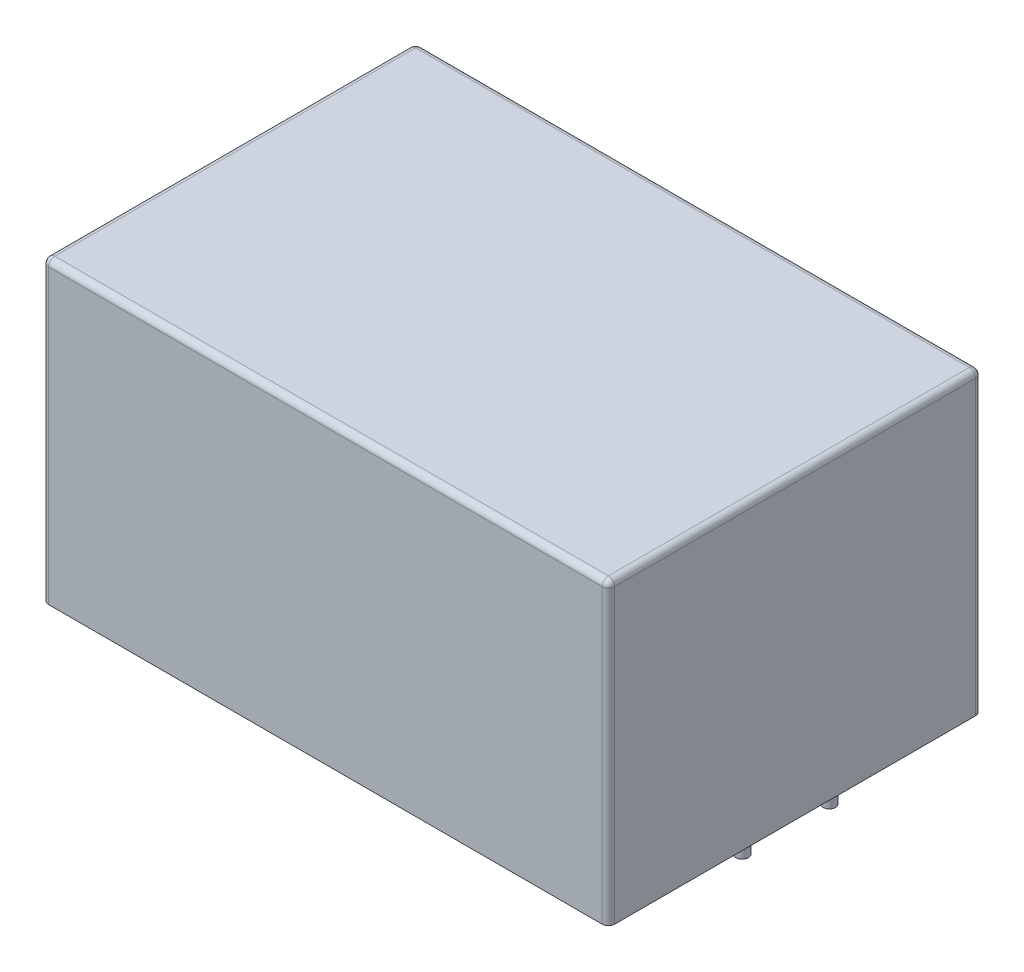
from build123d import *

# Parameters (mm, degrees)
SKETCH1_W           = 45.5
SKETCH1_H           = 30
BOSS_EXTRUDE1_DEPTH = 24
FILLET1_R           = 0.5
SKETCH2_R           = 0.5
BOSS_EXTRUDE2_DEPTH = 3.5


with BuildPart() as part:
    # Sketch1 → Boss-Extrude1 (new body)
    with BuildSketch(Plane(origin=(0, 0, 0), x_dir=(1, 0, 0), z_dir=(0, 1, 0))):
        Rectangle(SKETCH1_W, SKETCH1_H)
    extrude(amount=BOSS_EXTRUDE1_DEPTH)

    # Fillet1
    fillet1_edges = [part.edges().sort_by_distance(p)[0] for p in [
        (22.75, 24, 0),
        (0, 24, -15),
        (-22.75, 24, 0),
        (-22.75, 12, -15),
        (22.75, 12, -15),
        (22.75, 12, 15),
        (-22.75, 12, 15),
        (0, 24, 15),
    ]]
    fillet(fillet1_edges, radius=FILLET1_R)

    # Sketch2 → Boss-Extrude2 (add)
    with BuildSketch(Plane(origin=(0, 0, 0), x_dir=(-1, 0, 0), z_dir=(0, -1, 0))):
        with Locations(Location((19.5, -6, 0), (0, 0, 90))):
            Circle(SKETCH2_R)
        with Locations(Location((19.5, 6, 0), (0, 0, 90))):
            Circle(SKETCH2_R)
        with Locations(Location((-19.5, -1, 0), (0, 0, 90))):
            Circle(SKETCH2_R)
        with Locations(Location((-19.5, 6, 0), (0, 0, 90))):
            Circle(SKETCH2_R)
    extrude(amount=BOSS_EXTRUDE2_DEPTH)


solid = part.part
